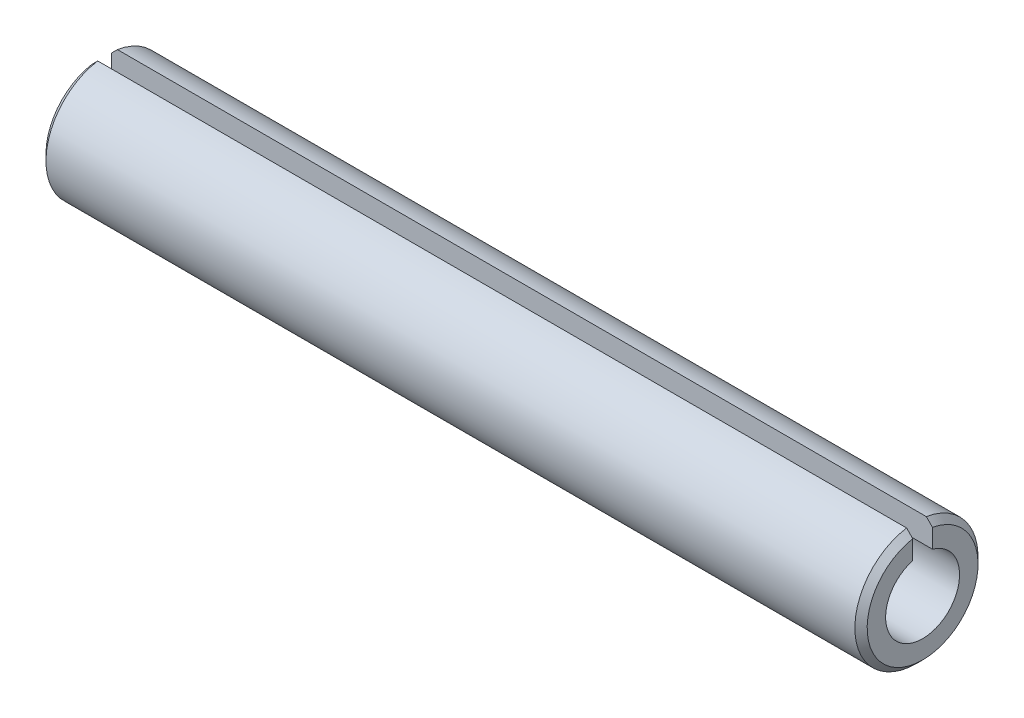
from build123d import *

# Parameters (mm, degrees)
ENL_V_MAT_EXTRU_2_DEPTH = 41.224370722


with BuildPart() as part:
    # Esquisse1 → Base-R_volution (revolve)
    with BuildSketch(Plane.XY):
        Polygon((0, 1.8), (0, 2.7), (0.3, 3), (39.7, 3), (40, 2.7), (40, 1.8), align=None)
    revolve(axis=Axis((0, 0, 0), (1, 0, 0)))

    # Esquisse2 → Enl_v. mat.-Extru.2 (cut, through all)
    with BuildSketch(Plane(origin=(0, 0, 0), x_dir=(0, 0, -1), z_dir=(1, 0, 0))):
        with BuildLine():
            Line((0.48, 2.961351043), (0.48, 1.734819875))
            ThreePointArc((0.48, 1.734819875), (0, 1.8), (-0.48, 1.734819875))
            Line((-0.48, 1.734819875), (-0.48, 2.961351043))
            ThreePointArc((-0.48, 2.961351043), (0, 3), (0.48, 2.961351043))
        make_face()
    extrude(amount=ENL_V_MAT_EXTRU_2_DEPTH, mode=Mode.SUBTRACT)


solid = part.part
